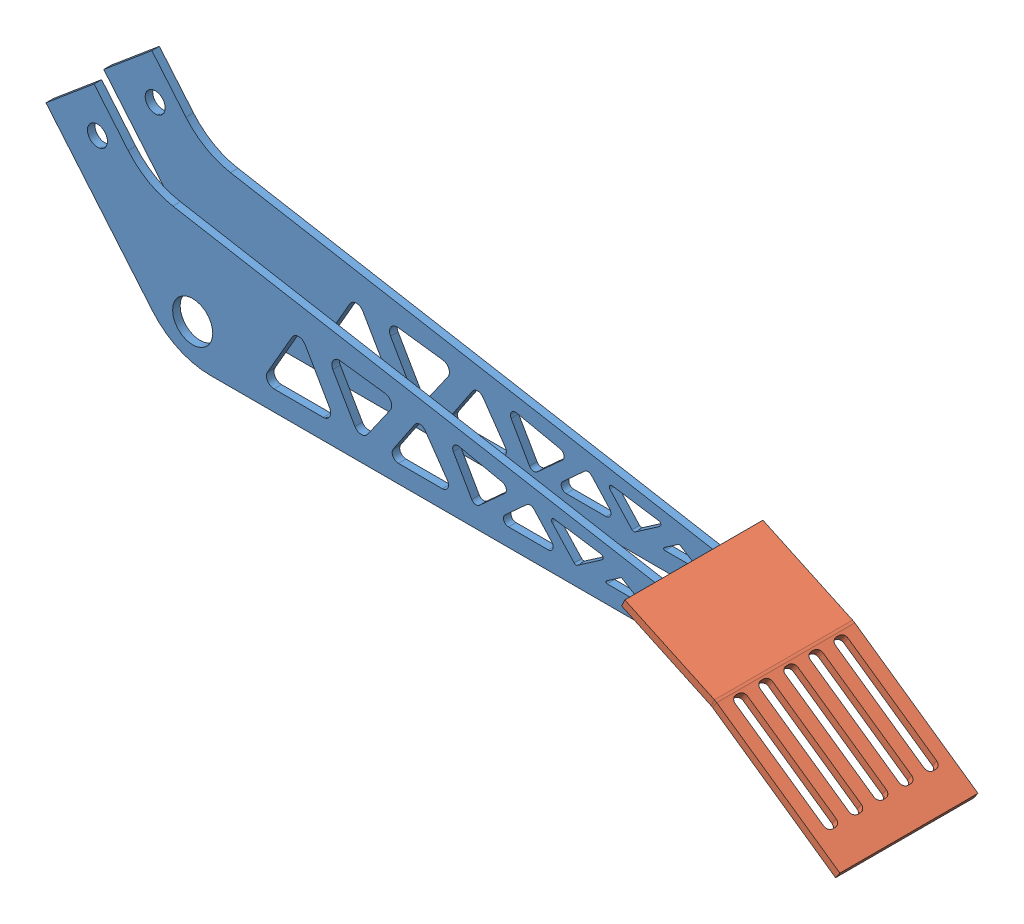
SolidWorks assembly Assem1.SLDASM, configuration Default (file format 15000). Lengths in mm.
Overall size (335.1 111.83 55).
3 component instances, 2 part files, 5 mates.
Components (placement in the parent):
- 1-1: 1.SLDPRT [Default] at (-74.9029 145.6463 227.136) size (280.02 77.35 3)
- 1-2: 1.SLDPRT [Default] at (-74.9029 145.6463 250.136) size (280.02 77.35 3)
- Part3-2: Part3.SLDPRT [Default] at (219.6287 77.6173 243.9805) x (0 0 -1) z (0.906786 -0.42159 0) size (55 13.43 99.35)
Mates (geometry in assembly coordinates):
- Distance1: distance = 20 mm anti-aligned: plane of 1-1 through (-74.9029 145.6463 230.136) normal (0 0 1); plane of 1-2 through (-74.9029 145.6463 250.136) normal (0 0 -1)
- Concentric1: concentric aligned: cylinder of 1-1 through (-54.4132 144.5635 230.136) axis (0 0 -1) radius 4; cylinder of 1-2 through (-54.4132 144.5635 253.136) axis (0 0 -1) radius 4
- Coincident11: coincident anti-aligned: plane of 1-2 through (-48.5603 202.3058 253.136) normal (0.42159 0.906786 0); plane of Part3-2 through (219.6287 77.6173 240.059) normal (-0.42159 -0.906786 0)
- Coincident13: coincident: line of 1-2 through (168.8486 101.2264 253.136) axis (0 0 -1); plane of Part3-2 through (170.1134 103.9467 263.7145) normal (-0.906786 0.42159 0)
- Distance5: distance = 14.5 mm aligned: plane of 1-2 through (-74.9029 145.6463 253.136) normal (0 0 1); plane of Part3-2 through (170.1134 103.9467 267.636) normal (0 0 1)
